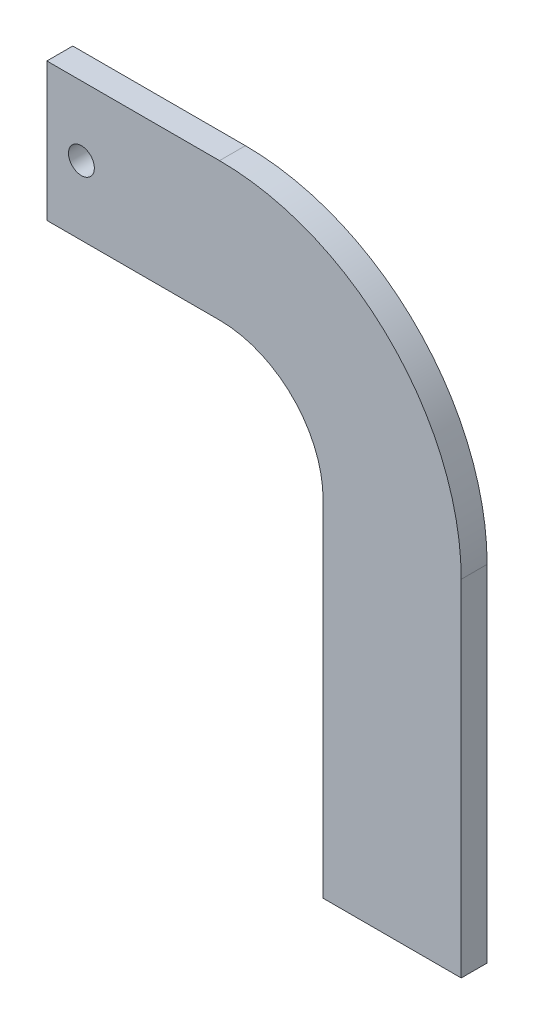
from build123d import *

# Parameters (mm, degrees)
SKETCH3_R      = 9.525
EXTRUDE1_DEPTH = 19.05


with BuildPart() as part:
    # Sketch3 → Extrude1 (new body)
    with BuildSketch(Plane.XY):
        with BuildLine():
            Line((0, 0), (101.6, 0))
            Line((101.6, 0), (101.6, 254))
            ThreePointArc((101.6, 254), (49.523585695, 379.723585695), (-76.2, 431.8))
            Line((-76.2, 431.8), (-203.2, 431.8))
            Line((-203.2, 431.8), (-203.2, 330.2))
            Line((-203.2, 330.2), (-76.2, 330.2))
            ThreePointArc((-76.2, 330.2), (-22.318463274, 307.881536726), (0, 254))
            Line((0, 254), (0, 0))
        make_face()
        with Locations(Location((-177.8, 381, 0), (0, 0, 180))):
            Circle(SKETCH3_R, mode=Mode.SUBTRACT)
    extrude(amount=EXTRUDE1_DEPTH)


solid = part.part
